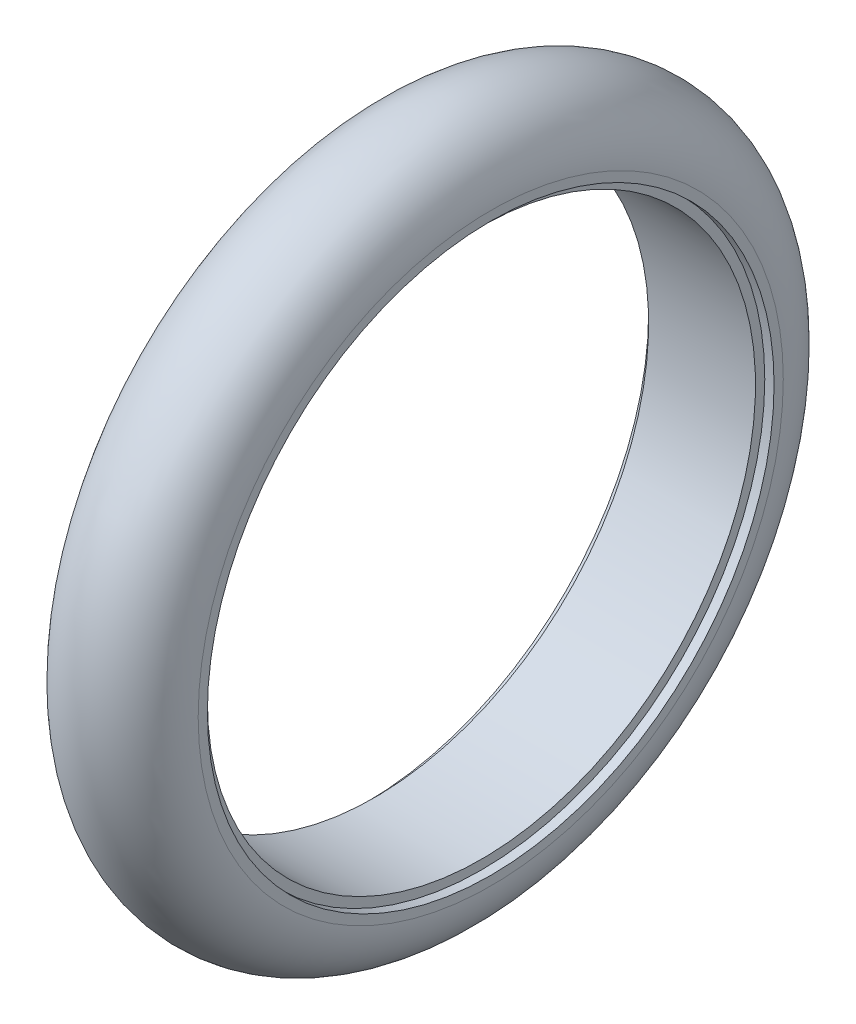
ISO-10303-21;
HEADER;
FILE_DESCRIPTION(('STEP AP214'),'2;1');
FILE_NAME('part.step','',(''),(''),'','','');
FILE_SCHEMA(('AUTOMOTIVE_DESIGN { 1 0 10303 214 1 1 1 1 }'));
ENDSEC;
DATA;
#1=APPLICATION_CONTEXT('core data for automotive mechanical design processes');
#2=APPLICATION_PROTOCOL_DEFINITION('international standard','automotive_design',2000,#1);
#3=PRODUCT_CONTEXT('',#1,'mechanical');
#4=PRODUCT('Part','Part','',(#3));
#5=PRODUCT_RELATED_PRODUCT_CATEGORY('part','',(#4));
#6=PRODUCT_DEFINITION_FORMATION('','',#4);
#7=PRODUCT_DEFINITION_CONTEXT('part definition',#1,'design');
#8=PRODUCT_DEFINITION('design','',#6,#7);
#9=PRODUCT_DEFINITION_SHAPE('','',#8);
#10=(LENGTH_UNIT() NAMED_UNIT(*) SI_UNIT(.MILLI.,.METRE.));
#11=(NAMED_UNIT(*) PLANE_ANGLE_UNIT() SI_UNIT($,.RADIAN.));
#12=(NAMED_UNIT(*) SI_UNIT($,.STERADIAN.) SOLID_ANGLE_UNIT());
#13=UNCERTAINTY_MEASURE_WITH_UNIT(LENGTH_MEASURE(1.E-05),#10,'distance_accuracy_value','');
#14=(GEOMETRIC_REPRESENTATION_CONTEXT(3) GLOBAL_UNCERTAINTY_ASSIGNED_CONTEXT((#13)) GLOBAL_UNIT_ASSIGNED_CONTEXT((#10,
#11,#12)) REPRESENTATION_CONTEXT('',''));
#15=CARTESIAN_POINT('',(0.,0.,0.));
#16=DIRECTION('',(0.,0.,1.));
#17=DIRECTION('',(1.,0.,0.));
#18=AXIS2_PLACEMENT_3D('',#15,#16,#17);
#19=CARTESIAN_POINT('',(-39.2801379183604,0.,0.));
#20=DIRECTION('',(-1.,0.,0.));
#21=DIRECTION('',(0.,0.,1.));
#22=AXIS2_PLACEMENT_3D('',#19,#20,#21);
#23=CYLINDRICAL_SURFACE('',#22,29.5);
#24=CARTESIAN_POINT('',(5.75000000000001,0.,0.));
#25=DIRECTION('',(-1.,0.,0.));
#26=DIRECTION('',(0.,0.,1.));
#27=AXIS2_PLACEMENT_3D('',#24,#25,#26);
#28=CIRCLE('',#27,29.5);
#29=CARTESIAN_POINT('',(5.75000000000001,0.,29.5));
#30=VERTEX_POINT('',#29);
#31=EDGE_CURVE('E63',#30,#30,#28,.T.);
#32=ORIENTED_EDGE('',*,*,#31,.F.);
#33=EDGE_LOOP('',(#32));
#34=FACE_BOUND('',#33,.T.);
#35=CARTESIAN_POINT('',(-5.75,0.,0.));
#36=DIRECTION('',(-1.,0.,0.));
#37=DIRECTION('',(0.,0.,1.));
#38=AXIS2_PLACEMENT_3D('',#35,#36,#37);
#39=CIRCLE('',#38,29.5);
#40=CARTESIAN_POINT('',(-5.75,0.,29.5));
#41=VERTEX_POINT('',#40);
#42=EDGE_CURVE('E10',#41,#41,#39,.T.);
#43=ORIENTED_EDGE('',*,*,#42,.T.);
#44=EDGE_LOOP('',(#43));
#45=FACE_BOUND('',#44,.T.);
#46=ADVANCED_FACE('F35',(#34,#45),#23,.F.);
#47=CARTESIAN_POINT('',(-5.75,29.5,0.));
#48=DIRECTION('',(1.,0.,0.));
#49=DIRECTION('',(0.,0.,-1.));
#50=AXIS2_PLACEMENT_3D('',#47,#48,#49);
#51=PLANE('',#50);
#52=ORIENTED_EDGE('',*,*,#42,.F.);
#53=EDGE_LOOP('',(#52));
#54=FACE_BOUND('',#53,.T.);
#55=CARTESIAN_POINT('',(-5.75,0.,0.));
#56=DIRECTION('',(-1.,0.,0.));
#57=DIRECTION('',(0.,0.,1.));
#58=AXIS2_PLACEMENT_3D('',#55,#56,#57);
#59=CIRCLE('',#58,30.5);
#60=CARTESIAN_POINT('',(-5.75,0.,30.5));
#61=VERTEX_POINT('',#60);
#62=EDGE_CURVE('E41',#61,#61,#59,.T.);
#63=ORIENTED_EDGE('',*,*,#62,.T.);
#64=EDGE_LOOP('',(#63));
#65=FACE_BOUND('',#64,.T.);
#66=ADVANCED_FACE('F70',(#54,#65),#51,.F.);
#67=CARTESIAN_POINT('',(-39.2801379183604,0.,0.));
#68=DIRECTION('',(-1.,0.,0.));
#69=DIRECTION('',(0.,0.,1.));
#70=AXIS2_PLACEMENT_3D('',#67,#68,#69);
#71=CYLINDRICAL_SURFACE('',#70,30.5);
#72=ORIENTED_EDGE('',*,*,#62,.F.);
#73=EDGE_LOOP('',(#72));
#74=FACE_BOUND('',#73,.T.);
#75=CARTESIAN_POINT('',(-6.74999999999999,0.,0.));
#76=DIRECTION('',(-1.,0.,0.));
#77=DIRECTION('',(0.,0.,1.));
#78=AXIS2_PLACEMENT_3D('',#75,#76,#77);
#79=CIRCLE('',#78,30.5);
#80=CARTESIAN_POINT('',(-6.74999999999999,0.,30.5));
#81=VERTEX_POINT('',#80);
#82=EDGE_CURVE('E45',#81,#81,#79,.T.);
#83=ORIENTED_EDGE('',*,*,#82,.T.);
#84=EDGE_LOOP('',(#83));
#85=FACE_BOUND('',#84,.T.);
#86=ADVANCED_FACE('F74',(#74,#85),#71,.F.);
#87=CARTESIAN_POINT('',(-6.75,30.5,0.));
#88=DIRECTION('',(1.,0.,0.));
#89=DIRECTION('',(0.,0.,-1.));
#90=AXIS2_PLACEMENT_3D('',#87,#88,#89);
#91=PLANE('',#90);
#92=ORIENTED_EDGE('',*,*,#82,.F.);
#93=EDGE_LOOP('',(#92));
#94=FACE_BOUND('',#93,.T.);
#95=CARTESIAN_POINT('',(-6.74999999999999,0.,0.));
#96=DIRECTION('',(-1.,0.,0.));
#97=DIRECTION('',(0.,0.,1.));
#98=AXIS2_PLACEMENT_3D('',#95,#96,#97);
#99=CIRCLE('',#98,31.4918302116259);
#100=CARTESIAN_POINT('',(-6.74999999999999,0.,31.4918302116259));
#101=VERTEX_POINT('',#100);
#102=EDGE_CURVE('E49',#101,#101,#99,.T.);
#103=ORIENTED_EDGE('',*,*,#102,.T.);
#104=EDGE_LOOP('',(#103));
#105=FACE_BOUND('',#104,.T.);
#106=ADVANCED_FACE('F79',(#94,#105),#91,.F.);
#107=CARTESIAN_POINT('',(0.,0.,0.));
#108=DIRECTION('',(-1.,0.,0.));
#109=DIRECTION('',(0.,0.,1.));
#110=AXIS2_PLACEMENT_3D('',#107,#108,#109);
#111=TOROIDAL_SURFACE('',#110,31.4918302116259,6.75);
#112=ORIENTED_EDGE('',*,*,#102,.F.);
#113=EDGE_LOOP('',(#112));
#114=FACE_BOUND('',#113,.T.);
#115=CARTESIAN_POINT('',(6.75000000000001,0.,0.));
#116=DIRECTION('',(-1.,0.,0.));
#117=DIRECTION('',(0.,0.,1.));
#118=AXIS2_PLACEMENT_3D('',#115,#116,#117);
#119=CIRCLE('',#118,31.4918302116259);
#120=CARTESIAN_POINT('',(6.75000000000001,0.,31.4918302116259));
#121=VERTEX_POINT('',#120);
#122=EDGE_CURVE('E54',#121,#121,#119,.T.);
#123=ORIENTED_EDGE('',*,*,#122,.T.);
#124=EDGE_LOOP('',(#123));
#125=FACE_BOUND('',#124,.T.);
#126=ADVANCED_FACE('F85',(#114,#125),#111,.T.);
#127=CARTESIAN_POINT('',(6.75,31.4918302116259,0.));
#128=DIRECTION('',(-1.,0.,0.));
#129=DIRECTION('',(0.,0.,1.));
#130=AXIS2_PLACEMENT_3D('',#127,#128,#129);
#131=PLANE('',#130);
#132=ORIENTED_EDGE('',*,*,#122,.F.);
#133=EDGE_LOOP('',(#132));
#134=FACE_BOUND('',#133,.T.);
#135=CARTESIAN_POINT('',(6.75000000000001,0.,0.));
#136=DIRECTION('',(-1.,0.,0.));
#137=DIRECTION('',(0.,0.,1.));
#138=AXIS2_PLACEMENT_3D('',#135,#136,#137);
#139=CIRCLE('',#138,30.5);
#140=CARTESIAN_POINT('',(6.75000000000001,0.,30.5));
#141=VERTEX_POINT('',#140);
#142=EDGE_CURVE('E57',#141,#141,#139,.T.);
#143=ORIENTED_EDGE('',*,*,#142,.T.);
#144=EDGE_LOOP('',(#143));
#145=FACE_BOUND('',#144,.T.);
#146=ADVANCED_FACE('F89',(#134,#145),#131,.F.);
#147=CARTESIAN_POINT('',(-39.2801379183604,0.,0.));
#148=DIRECTION('',(-1.,0.,0.));
#149=DIRECTION('',(0.,0.,1.));
#150=AXIS2_PLACEMENT_3D('',#147,#148,#149);
#151=CYLINDRICAL_SURFACE('',#150,30.5);
#152=ORIENTED_EDGE('',*,*,#142,.F.);
#153=EDGE_LOOP('',(#152));
#154=FACE_BOUND('',#153,.T.);
#155=CARTESIAN_POINT('',(5.75000000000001,0.,0.));
#156=DIRECTION('',(-1.,0.,0.));
#157=DIRECTION('',(0.,0.,1.));
#158=AXIS2_PLACEMENT_3D('',#155,#156,#157);
#159=CIRCLE('',#158,30.5);
#160=CARTESIAN_POINT('',(5.75000000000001,0.,30.5));
#161=VERTEX_POINT('',#160);
#162=EDGE_CURVE('E60',#161,#161,#159,.T.);
#163=ORIENTED_EDGE('',*,*,#162,.T.);
#164=EDGE_LOOP('',(#163));
#165=FACE_BOUND('',#164,.T.);
#166=ADVANCED_FACE('F93',(#154,#165),#151,.F.);
#167=CARTESIAN_POINT('',(5.75000000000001,30.5,0.));
#168=DIRECTION('',(-1.,0.,0.));
#169=DIRECTION('',(0.,0.,1.));
#170=AXIS2_PLACEMENT_3D('',#167,#168,#169);
#171=PLANE('',#170);
#172=ORIENTED_EDGE('',*,*,#162,.F.);
#173=EDGE_LOOP('',(#172));
#174=FACE_BOUND('',#173,.T.);
#175=ORIENTED_EDGE('',*,*,#31,.T.);
#176=EDGE_LOOP('',(#175));
#177=FACE_BOUND('',#176,.T.);
#178=ADVANCED_FACE('F67',(#174,#177),#171,.F.);
#179=CLOSED_SHELL('',(#46,#66,#86,#106,#126,#146,#166,#178));
#180=MANIFOLD_SOLID_BREP('B2',#179);
#181=ADVANCED_BREP_SHAPE_REPRESENTATION('',(#18,#180),#14);
#182=SHAPE_DEFINITION_REPRESENTATION(#9,#181);
ENDSEC;
END-ISO-10303-21;
